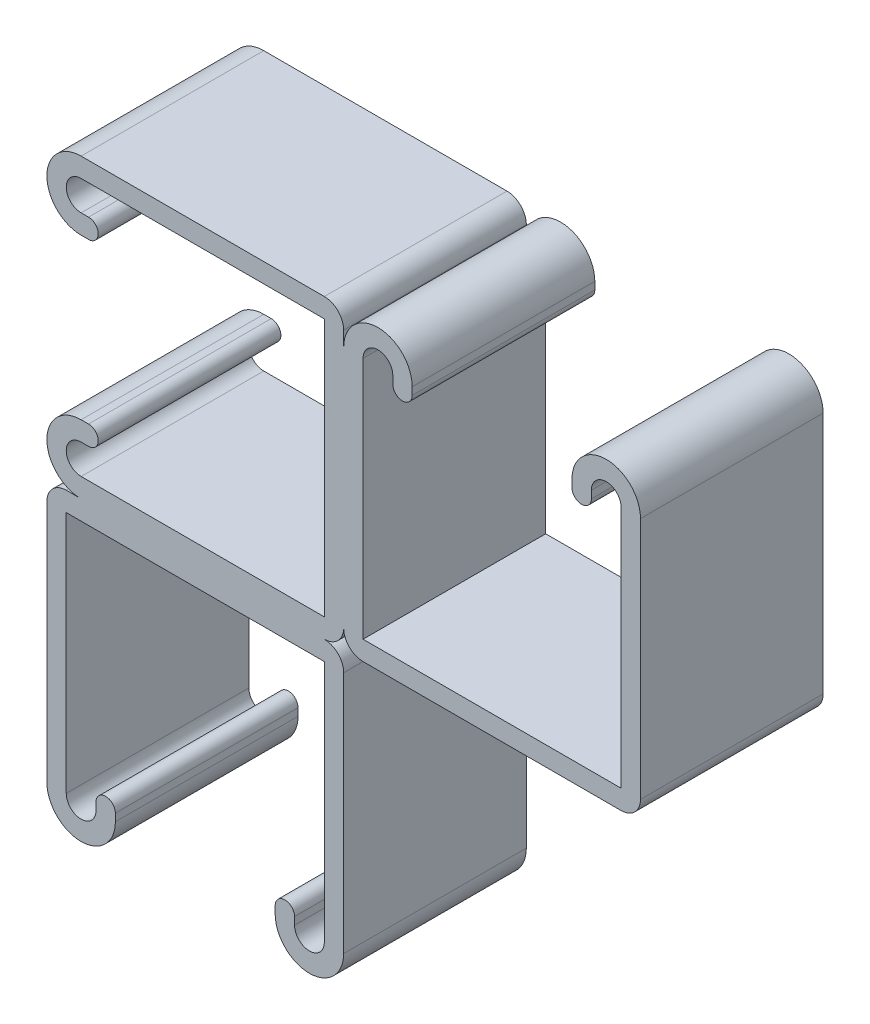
from build123d import *

# Parameters (mm, degrees)
BASE_EXTRUDE_DEPTH = 12.7
CIRPATTERN1_COUNT  = 3
CIRPATTERN1_ANGLE  = 180


with BuildPart() as part:
    # Sketch1 → Base-Extrude (new, symmetric)
    with BuildSketch(Plane.XY):
        with BuildLine():
            Line((0, 36.5125), (0, 2.6924))
            ThreePointArc((0, 2.6924), (0.788585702, 0.788585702), (2.6924, 0))
            Line((2.6924, 0), (38.5826, 0))
            ThreePointArc((38.5826, 0), (40.486414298, 0.788585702), (41.275, 2.6924))
            Line((41.275, 2.6924), (41.275, 36.5125))
            ThreePointArc((41.275, 36.5125), (36.5125, 41.275), (31.75, 36.5125))
            Line((31.75, 36.5125), (31.75, 35.47745))
            ThreePointArc((31.75, 35.47745), (33.0962, 34.13125), (34.4424, 35.47745))
            Line((34.4424, 35.47745), (34.4424, 36.5125))
            ThreePointArc((34.4424, 36.5125), (36.5125, 38.5826), (38.5826, 36.5125))
            Line((38.5826, 36.5125), (38.5826, 2.6924))
            Line((38.5826, 2.6924), (2.6924, 2.6924))
            Line((2.6924, 2.6924), (2.6924, 36.5125))
            ThreePointArc((2.6924, 36.5125), (4.7625, 38.5826), (6.8326, 36.5125))
            Line((6.8326, 36.5125), (6.8326, 35.47745))
            ThreePointArc((6.8326, 35.47745), (8.1788, 34.13125), (9.525, 35.47745))
            Line((9.525, 35.47745), (9.525, 36.5125))
            ThreePointArc((9.525, 36.5125), (4.7625, 41.275), (0, 36.5125))
        make_face()
    base_extrude = extrude(amount=BASE_EXTRUDE_DEPTH, both=True)

    # CirPattern1: Base-Extrude ×3 about axis
    cirpattern1_axis = Axis((0, 0, 0), (0, 0, 1))
    for i in range(1, CIRPATTERN1_COUNT):
        add(base_extrude.rotate(cirpattern1_axis, i * CIRPATTERN1_ANGLE / (CIRPATTERN1_COUNT - 1)))


solid = part.part
